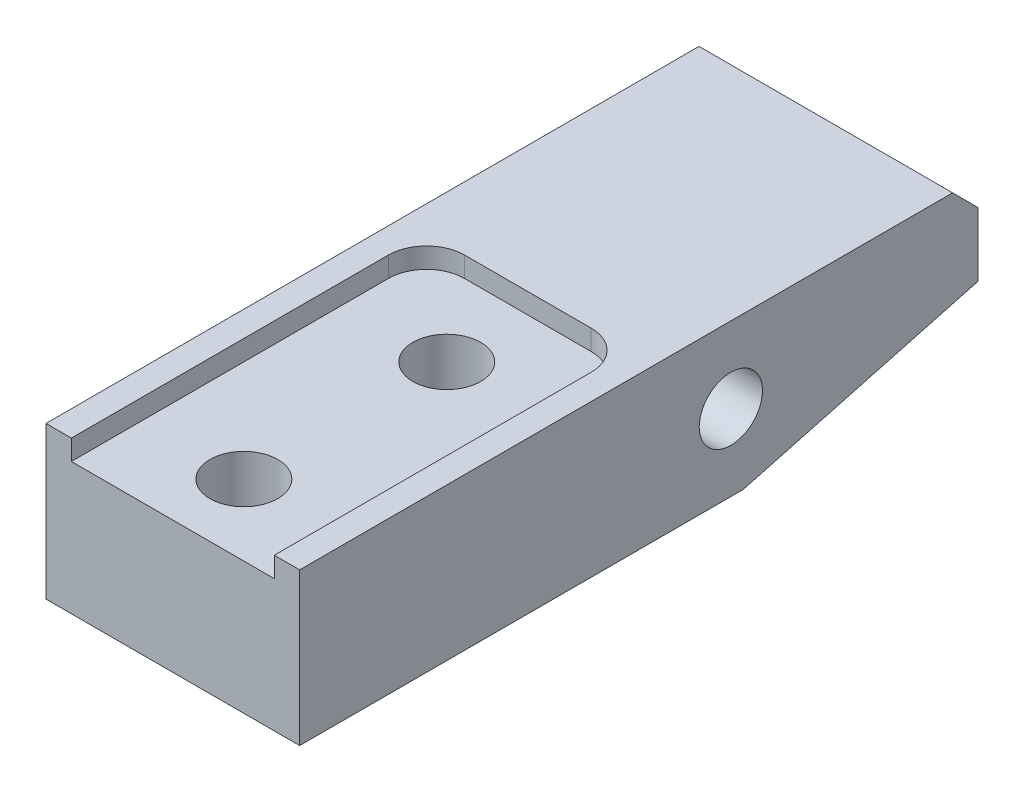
from build123d import *

# Parameters (mm, degrees)
SKETCH1_W                    = 31.75
SKETCH1_H                    = 84.9122
EXTRUDE1_DEPTH               = 9.525
SKETCH2_W                    = 25.4
SKETCH2_H                    = 44.45
KEY_POCKET_DEPTH             = 2.54
FILLET1_R                    = 4.7752
M10_X_1_5_THRU_MOUNT_HOLES_D = 8.5
SKETCH6_R                    = 3.9624
CUT_EXTRUDE2_DEPTH           = 54.863796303
CUT_EXTRUDE3_DEPTH           = 54.863796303
CHAMFER1_SIZE                = 3.175


with BuildPart() as part:
    # Sketch1 → Extrude1 (new, symmetric)
    with BuildSketch(Plane(origin=(0, 0, 0), x_dir=(1, 0, 0), z_dir=(0, 1, 0))):
        Rectangle(SKETCH1_W, SKETCH1_H)
    extrude(amount=EXTRUDE1_DEPTH, both=True)

    # Sketch2 → Key Pocket (cut)
    with BuildSketch(Plane(origin=(0, 9.525, 0), x_dir=(-1, 0, 0), z_dir=(0, 1, 0))):
        with Locations((0, 20.2311)):
            Rectangle(SKETCH2_W, SKETCH2_H)
    extrude(amount=-KEY_POCKET_DEPTH, mode=Mode.SUBTRACT)

    # Fillet1
    fillet1_edges = [part.edges().sort_by_distance(p)[0] for p in [
        (12.7, 8.255, -1.9939),
        (-12.7, 8.255, -1.9939),
    ]]
    fillet(fillet1_edges, radius=FILLET1_R)

    # M10 X 1.5 Thru _Mount Holes (through all)
    with Locations(Plane(origin=(0, 6.985, 0), x_dir=(-1, 0, 0), z_dir=(0, 1, 0))):
        with Locations((0, 8.1661), (0, 33.5661)):
            Hole(M10_X_1_5_THRU_MOUNT_HOLES_D / 2)

    # Sketch6 → Cut-Extrude2 (cut, through all)
    with BuildSketch(Plane.ZY.offset(15.875)):
        with Locations((-11.5189, 0)):
            Circle(SKETCH6_R)
    extrude(amount=-CUT_EXTRUDE2_DEPTH, mode=Mode.SUBTRACT)

    # Sketch7 → Cut-Extrude3 (cut, through all)
    with BuildSketch(Plane.ZY.offset(15.875)):
        Polygon((-13.069931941, -9.525), (-42.4561, -1.651), (-42.4561, -9.525), align=None)
    extrude(amount=-CUT_EXTRUDE3_DEPTH, mode=Mode.SUBTRACT)

    # Chamfer1
    chamfer1_edges = [part.edges().sort_by_distance(p)[0] for p in [
        (0, 9.525, -42.4561),
    ]]
    chamfer(chamfer1_edges, length=CHAMFER1_SIZE)


solid = part.part
